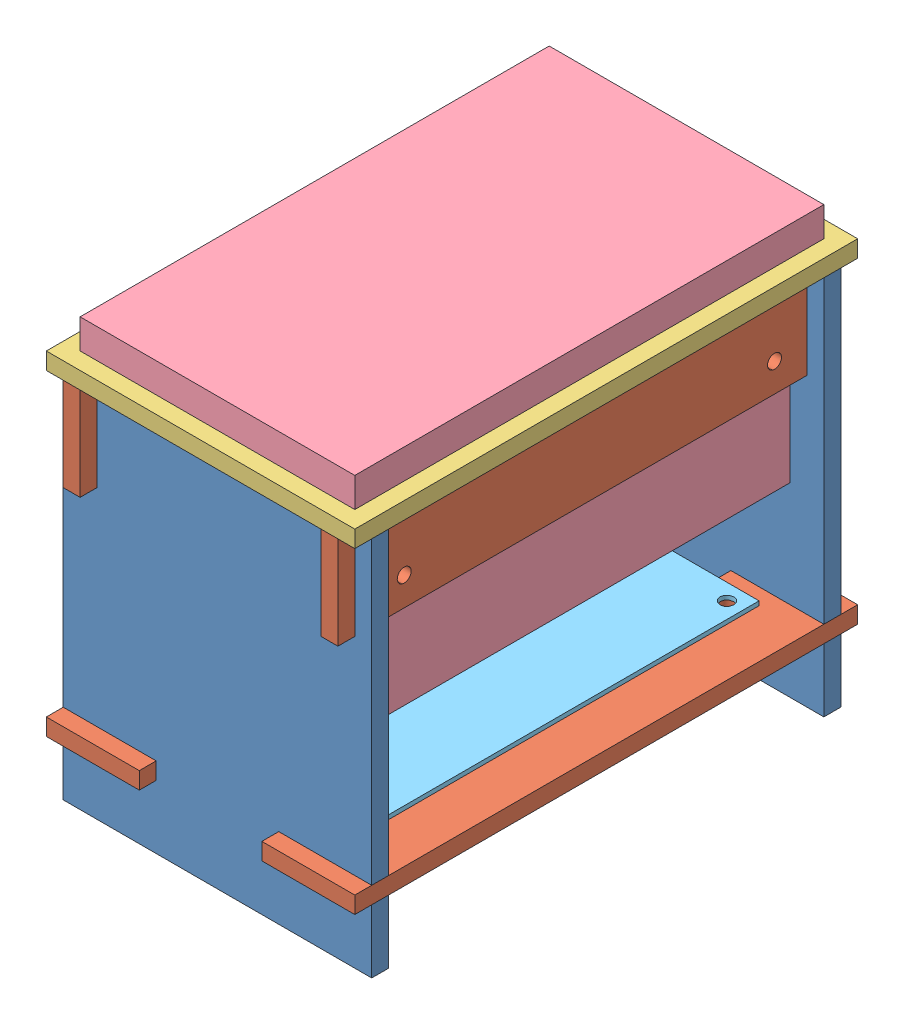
SolidWorks assembly stand.SLDASM, configuration Default (file format 4100). Lengths in mm.
Overall size (73 101 119).
9 component instances, 5 part files, 18 mates.
Components (placement in the parent):
- front-1: front.SLDPRT [Default] at (-33.2771 -10.8 24.8972) size (73 90 4)
- front-2: front.SLDPRT [Default] at (-33.2771 -10.8 -82.1028) size (73 90 4)
- connector-1: connector.SLDPRT [Default] at (-61.7771 23.2 -26.6028) x (0 1 0) z (0 0 1) size (22 4 119)
- connector-2: connector.SLDPRT [Default] at (-7.7771 -40.8 -26.6028) size (22 4 119)
- connector-3: connector.SLDPRT [Default] at (-58.7771 -36.8 -26.6028) x (-1 0 0) z (0 0 1) size (22 4 119)
- connector-4: connector.SLDPRT [Default] at (-0.7771 23.2 -26.6028) x (0 1 0) z (0 0 1) size (22 4 119)
- top-1: top.SLDPRT [Default] at (-33.2771 34.2 -26.6028) x (0 0 -1) z (1 0 0) size (119 4 73)
- printer-1: printer.SLDPRT [Default] at (-33.2771 -11.8 -26.6028) x (0 0 -1) z (1 0 0) size (111 57 65)
- web_platform-1: web_platform.SLDPRT [Default] at (-8.2371 -36.8 21.0222) x (0 0 -1) z (1 0 0) size (95.25 14.6 53.98)
Mates (geometry in assembly coordinates):
- Coincident1: coincident anti-aligned: line of connector-2 through (-6.7771 -36.8 24.8972) axis (0 -1 0); line of front-1 through (-6.7771 -40.8 24.8972) axis (0 1 0)
- Coincident2: coincident aligned: line of connector-2 through (-6.7771 -40.8 28.8972) axis (-1 0 0); line of front-1 through (3.2229 -40.8 28.8972) axis (-1 0 0)
- Coincident3: coincident aligned: line of connector-2 through (-6.7771 -40.8 -78.1028) axis (-1 0 0); line of front-2 through (3.2229 -40.8 -78.1028) axis (-1 0 0)
- Coincident4: coincident anti-aligned: line of connector-2 through (-6.7771 -36.8 -78.1028) axis (0 -1 0); line of front-2 through (-6.7771 -40.8 -78.1028) axis (0 1 0)
- Coincident5: coincident anti-aligned: line of connector-3 through (-59.7771 -40.8 28.8972) axis (1 0 0); line of front-1 through (-59.7771 -40.8 28.8972) axis (-1 0 0)
- Coincident6: coincident anti-aligned: line of connector-3 through (-59.7771 -40.8 28.8972) axis (0 1 0); line of front-1 through (-59.7771 -36.8 28.8972) axis (0 -1 0)
- Coincident7: coincident anti-aligned: line of connector-1 through (-65.7771 24.2 28.8972) axis (0 -1 0); line of front-1 through (-65.7771 24.2 28.8972) axis (0 1 0)
- Coincident8: coincident anti-aligned: line of connector-1 through (-65.7771 24.2 28.8972) axis (1 0 0); moEndPointRef_w of front-1
- Coincident9: coincident aligned: line of connector-4 through (-0.7771 24.2 28.8972) axis (0 -1 0); line of front-1 through (-0.7771 34.2 28.8972) axis (0 -1 0)
- Coincident10: coincident anti-aligned: line of connector-4 through (-4.7771 24.2 28.8972) axis (1 0 0); line of front-1 through (-0.7771 24.2 28.8972) axis (-1 0 0)
- Coincident20: coincident anti-aligned: plane of top-1 through (-69.7771 34.2 -86.1028) normal (0 -1 0); plane of front-1 through (-61.7771 34.2 28.8972) normal (0 1 0)
- Coincident15: coincident aligned: line of top-1 through (-4.7771 38.2 24.8972) axis (0 0 -1); line of printer-1 through (-4.7771 38.2 24.8972) axis (0 0 -1)
- Coincident16: coincident aligned: line of top-1 through (-61.7771 38.2 24.8972) axis (1 0 0); line of printer-1 through (-61.7771 38.2 24.8972) axis (1 0 0)
- Coincident17: coincident anti-aligned: plane of connector-2 through (3.2229 -36.8 -86.1028) normal (0 1 0); plane of web_platform-1 through (-58.3171 -36.8 21.0222) normal (0 -1 0)
- Concentric3: concentric anti-aligned: circle of connector-3; circle of web_platform-1
- Concentric4: concentric aligned: circle of connector-2; circle of web_platform-1
- Coincident18: coincident aligned: plane of connector-1 through (-65.7771 12.2 32.8972) normal (0 0 1); plane of top-1 through (3.2229 38.2 32.8972) normal (0 0 1)
- Coincident19: coincident aligned: plane of top-1 through (3.2229 38.2 32.8972) normal (1 0 0); plane of front-1 through (3.2229 34.2 28.8972) normal (1 0 0)
